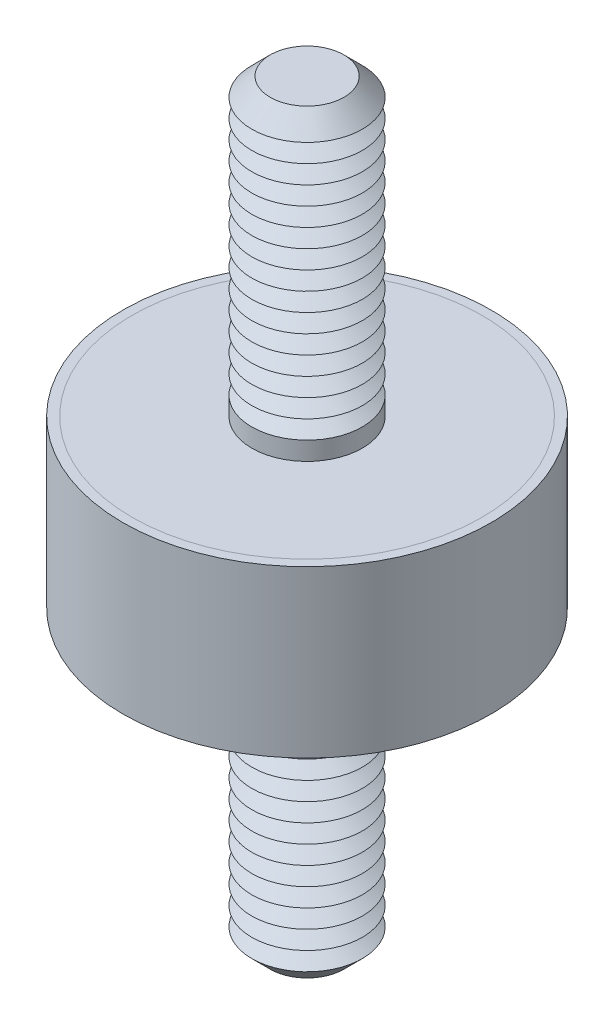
ISO-10303-21;
HEADER;
FILE_DESCRIPTION(('STEP AP214'),'2;1');
FILE_NAME('part.step','',(''),(''),'','','');
FILE_SCHEMA(('AUTOMOTIVE_DESIGN { 1 0 10303 214 1 1 1 1 }'));
ENDSEC;
DATA;
#1=APPLICATION_CONTEXT('core data for automotive mechanical design processes');
#2=APPLICATION_PROTOCOL_DEFINITION('international standard','automotive_design',2000,#1);
#3=PRODUCT_CONTEXT('',#1,'mechanical');
#4=PRODUCT('Part','Part','',(#3));
#5=PRODUCT_RELATED_PRODUCT_CATEGORY('part','',(#4));
#6=PRODUCT_DEFINITION_FORMATION('','',#4);
#7=PRODUCT_DEFINITION_CONTEXT('part definition',#1,'design');
#8=PRODUCT_DEFINITION('design','',#6,#7);
#9=PRODUCT_DEFINITION_SHAPE('','',#8);
#10=(LENGTH_UNIT() NAMED_UNIT(*) SI_UNIT(.MILLI.,.METRE.));
#11=(NAMED_UNIT(*) PLANE_ANGLE_UNIT() SI_UNIT($,.RADIAN.));
#12=(NAMED_UNIT(*) SI_UNIT($,.STERADIAN.) SOLID_ANGLE_UNIT());
#13=UNCERTAINTY_MEASURE_WITH_UNIT(LENGTH_MEASURE(1.E-05),#10,'distance_accuracy_value','');
#14=(GEOMETRIC_REPRESENTATION_CONTEXT(3) GLOBAL_UNCERTAINTY_ASSIGNED_CONTEXT((#13)) GLOBAL_UNIT_ASSIGNED_CONTEXT((#10,
#11,#12)) REPRESENTATION_CONTEXT('',''));
#15=CARTESIAN_POINT('',(0.,0.,0.));
#16=DIRECTION('',(0.,0.,1.));
#17=DIRECTION('',(1.,0.,0.));
#18=AXIS2_PLACEMENT_3D('',#15,#16,#17);
#19=CARTESIAN_POINT('',(0.,-20.5,0.));
#20=DIRECTION('',(0.,1.,0.));
#21=DIRECTION('',(0.,0.,1.));
#22=AXIS2_PLACEMENT_3D('',#19,#20,#21);
#23=CYLINDRICAL_SURFACE('',#22,3.);
#24=CARTESIAN_POINT('',(0.,-4.5,0.));
#25=DIRECTION('',(0.,-1.,0.));
#26=DIRECTION('',(0.,0.,-1.));
#27=AXIS2_PLACEMENT_3D('',#24,#25,#26);
#28=CIRCLE('',#27,3.);
#29=CARTESIAN_POINT('',(0.,-4.5,-3.));
#30=VERTEX_POINT('',#29);
#31=EDGE_CURVE('P0_E21',#30,#30,#28,.T.);
#32=ORIENTED_EDGE('',*,*,#31,.T.);
#33=EDGE_LOOP('',(#32));
#34=FACE_BOUND('',#33,.T.);
#35=CARTESIAN_POINT('',(0.,-5.5,0.));
#36=DIRECTION('',(0.,1.,0.));
#37=DIRECTION('',(0.,0.,1.));
#38=AXIS2_PLACEMENT_3D('',#35,#36,#37);
#39=CIRCLE('',#38,3.);
#40=CARTESIAN_POINT('',(0.,-5.5,3.));
#41=VERTEX_POINT('',#40);
#42=EDGE_CURVE('P0_E33',#41,#41,#39,.T.);
#43=ORIENTED_EDGE('',*,*,#42,.T.);
#44=EDGE_LOOP('',(#43));
#45=FACE_BOUND('',#44,.T.);
#46=ADVANCED_FACE('P0_F14',(#34,#45),#23,.T.);
#47=CARTESIAN_POINT('',(0.,-4.5,0.));
#48=DIRECTION('',(0.,1.,0.));
#49=DIRECTION('',(0.,0.,1.));
#50=AXIS2_PLACEMENT_3D('',#47,#48,#49);
#51=CYLINDRICAL_SURFACE('',#50,9.5);
#52=CARTESIAN_POINT('',(0.,-4.5,0.));
#53=DIRECTION('',(0.,1.,0.));
#54=DIRECTION('',(0.,0.,1.));
#55=AXIS2_PLACEMENT_3D('',#52,#53,#54);
#56=CIRCLE('',#55,9.5);
#57=CARTESIAN_POINT('',(0.,-4.5,9.5));
#58=VERTEX_POINT('',#57);
#59=EDGE_CURVE('P0_E25',#58,#58,#56,.T.);
#60=ORIENTED_EDGE('',*,*,#59,.T.);
#61=EDGE_LOOP('',(#60));
#62=FACE_BOUND('',#61,.T.);
#63=CARTESIAN_POINT('',(0.,-4.,0.));
#64=DIRECTION('',(0.,1.,0.));
#65=DIRECTION('',(0.,0.,1.));
#66=AXIS2_PLACEMENT_3D('',#63,#64,#65);
#67=CIRCLE('',#66,9.5);
#68=CARTESIAN_POINT('',(0.,-4.,9.5));
#69=VERTEX_POINT('',#68);
#70=EDGE_CURVE('P0_E30',#69,#69,#67,.T.);
#71=ORIENTED_EDGE('',*,*,#70,.F.);
#72=EDGE_LOOP('',(#71));
#73=FACE_BOUND('',#72,.T.);
#74=ADVANCED_FACE('P0_F145',(#62,#73),#51,.T.);
#75=CARTESIAN_POINT('',(0.,-4.5,0.));
#76=DIRECTION('',(0.,1.,0.));
#77=DIRECTION('',(0.,0.,1.));
#78=AXIS2_PLACEMENT_3D('',#75,#76,#77);
#79=PLANE('',#78);
#80=ORIENTED_EDGE('',*,*,#31,.F.);
#81=EDGE_LOOP('',(#80));
#82=FACE_BOUND('',#81,.T.);
#83=ORIENTED_EDGE('',*,*,#59,.F.);
#84=EDGE_LOOP('',(#83));
#85=FACE_BOUND('',#84,.T.);
#86=ADVANCED_FACE('P0_F150',(#82,#85),#79,.F.);
#87=CARTESIAN_POINT('',(0.,-4.,0.));
#88=DIRECTION('',(0.,1.,0.));
#89=DIRECTION('',(0.,0.,1.));
#90=AXIS2_PLACEMENT_3D('',#87,#88,#89);
#91=PLANE('',#90);
#92=ORIENTED_EDGE('',*,*,#70,.T.);
#93=EDGE_LOOP('',(#92));
#94=FACE_BOUND('',#93,.T.);
#95=ADVANCED_FACE('P0_F156',(#94),#91,.T.);
#96=CARTESIAN_POINT('',(0.,-5.5,0.));
#97=DIRECTION('',(0.,1.,0.));
#98=DIRECTION('',(0.,0.,1.));
#99=AXIS2_PLACEMENT_3D('',#96,#97,#98);
#100=CONICAL_SURFACE('',#99,3.,1.0471975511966);
#101=CARTESIAN_POINT('',(0.,-6.,0.));
#102=DIRECTION('',(0.,1.,0.));
#103=DIRECTION('',(0.,0.,1.));
#104=AXIS2_PLACEMENT_3D('',#101,#102,#103);
#105=CIRCLE('',#104,2.13397459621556);
#106=CARTESIAN_POINT('',(0.,-6.,2.13397459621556));
#107=VERTEX_POINT('',#106);
#108=EDGE_CURVE('P0_E39',#107,#107,#105,.T.);
#109=ORIENTED_EDGE('',*,*,#108,.T.);
#110=EDGE_LOOP('',(#109));
#111=FACE_BOUND('',#110,.T.);
#112=ORIENTED_EDGE('',*,*,#42,.F.);
#113=EDGE_LOOP('',(#112));
#114=FACE_BOUND('',#113,.T.);
#115=ADVANCED_FACE('P0_F159',(#111,#114),#100,.T.);
#116=CARTESIAN_POINT('',(0.,-6.,0.));
#117=DIRECTION('',(0.,-1.,0.));
#118=DIRECTION('',(0.,0.,-1.));
#119=AXIS2_PLACEMENT_3D('',#116,#117,#118);
#120=CONICAL_SURFACE('',#119,2.13397459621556,1.0471975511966);
#121=CARTESIAN_POINT('',(0.,-6.5,0.));
#122=DIRECTION('',(0.,1.,0.));
#123=DIRECTION('',(0.,0.,1.));
#124=AXIS2_PLACEMENT_3D('',#121,#122,#123);
#125=CIRCLE('',#124,3.);
#126=CARTESIAN_POINT('',(0.,-6.5,3.));
#127=VERTEX_POINT('',#126);
#128=EDGE_CURVE('P0_E43',#127,#127,#125,.T.);
#129=ORIENTED_EDGE('',*,*,#128,.T.);
#130=EDGE_LOOP('',(#129));
#131=FACE_BOUND('',#130,.T.);
#132=ORIENTED_EDGE('',*,*,#108,.F.);
#133=EDGE_LOOP('',(#132));
#134=FACE_BOUND('',#133,.T.);
#135=ADVANCED_FACE('P0_F163',(#131,#134),#120,.T.);
#136=CARTESIAN_POINT('',(0.,-6.5,0.));
#137=DIRECTION('',(0.,1.,0.));
#138=DIRECTION('',(0.,0.,1.));
#139=AXIS2_PLACEMENT_3D('',#136,#137,#138);
#140=CONICAL_SURFACE('',#139,3.,1.0471975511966);
#141=CARTESIAN_POINT('',(0.,-7.,0.));
#142=DIRECTION('',(0.,1.,0.));
#143=DIRECTION('',(0.,0.,1.));
#144=AXIS2_PLACEMENT_3D('',#141,#142,#143);
#145=CIRCLE('',#144,2.13397459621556);
#146=CARTESIAN_POINT('',(0.,-7.,2.13397459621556));
#147=VERTEX_POINT('',#146);
#148=EDGE_CURVE('P0_E47',#147,#147,#145,.T.);
#149=ORIENTED_EDGE('',*,*,#148,.T.);
#150=EDGE_LOOP('',(#149));
#151=FACE_BOUND('',#150,.T.);
#152=ORIENTED_EDGE('',*,*,#128,.F.);
#153=EDGE_LOOP('',(#152));
#154=FACE_BOUND('',#153,.T.);
#155=ADVANCED_FACE('P0_F167',(#151,#154),#140,.T.);
#156=CARTESIAN_POINT('',(0.,-7.,0.));
#157=DIRECTION('',(0.,-1.,0.));
#158=DIRECTION('',(0.,0.,-1.));
#159=AXIS2_PLACEMENT_3D('',#156,#157,#158);
#160=CONICAL_SURFACE('',#159,2.13397459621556,1.0471975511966);
#161=CARTESIAN_POINT('',(0.,-7.5,0.));
#162=DIRECTION('',(0.,1.,0.));
#163=DIRECTION('',(0.,0.,1.));
#164=AXIS2_PLACEMENT_3D('',#161,#162,#163);
#165=CIRCLE('',#164,3.);
#166=CARTESIAN_POINT('',(0.,-7.5,3.));
#167=VERTEX_POINT('',#166);
#168=EDGE_CURVE('P0_E52',#167,#167,#165,.T.);
#169=ORIENTED_EDGE('',*,*,#168,.T.);
#170=EDGE_LOOP('',(#169));
#171=FACE_BOUND('',#170,.T.);
#172=ORIENTED_EDGE('',*,*,#148,.F.);
#173=EDGE_LOOP('',(#172));
#174=FACE_BOUND('',#173,.T.);
#175=ADVANCED_FACE('P0_F174',(#171,#174),#160,.T.);
#176=CARTESIAN_POINT('',(0.,-7.5,0.));
#177=DIRECTION('',(0.,1.,0.));
#178=DIRECTION('',(0.,0.,1.));
#179=AXIS2_PLACEMENT_3D('',#176,#177,#178);
#180=CONICAL_SURFACE('',#179,3.,1.0471975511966);
#181=CARTESIAN_POINT('',(0.,-8.,0.));
#182=DIRECTION('',(0.,1.,0.));
#183=DIRECTION('',(0.,0.,1.));
#184=AXIS2_PLACEMENT_3D('',#181,#182,#183);
#185=CIRCLE('',#184,2.13397459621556);
#186=CARTESIAN_POINT('',(0.,-8.,2.13397459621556));
#187=VERTEX_POINT('',#186);
#188=EDGE_CURVE('P0_E55',#187,#187,#185,.T.);
#189=ORIENTED_EDGE('',*,*,#188,.T.);
#190=EDGE_LOOP('',(#189));
#191=FACE_BOUND('',#190,.T.);
#192=ORIENTED_EDGE('',*,*,#168,.F.);
#193=EDGE_LOOP('',(#192));
#194=FACE_BOUND('',#193,.T.);
#195=ADVANCED_FACE('P0_F178',(#191,#194),#180,.T.);
#196=CARTESIAN_POINT('',(0.,-8.,0.));
#197=DIRECTION('',(0.,-1.,0.));
#198=DIRECTION('',(0.,0.,-1.));
#199=AXIS2_PLACEMENT_3D('',#196,#197,#198);
#200=CONICAL_SURFACE('',#199,2.13397459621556,1.0471975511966);
#201=CARTESIAN_POINT('',(0.,-8.5,0.));
#202=DIRECTION('',(0.,1.,0.));
#203=DIRECTION('',(0.,0.,1.));
#204=AXIS2_PLACEMENT_3D('',#201,#202,#203);
#205=CIRCLE('',#204,3.);
#206=CARTESIAN_POINT('',(0.,-8.5,3.));
#207=VERTEX_POINT('',#206);
#208=EDGE_CURVE('P0_E58',#207,#207,#205,.T.);
#209=ORIENTED_EDGE('',*,*,#208,.T.);
#210=EDGE_LOOP('',(#209));
#211=FACE_BOUND('',#210,.T.);
#212=ORIENTED_EDGE('',*,*,#188,.F.);
#213=EDGE_LOOP('',(#212));
#214=FACE_BOUND('',#213,.T.);
#215=ADVANCED_FACE('P0_F182',(#211,#214),#200,.T.);
#216=CARTESIAN_POINT('',(0.,-8.5,0.));
#217=DIRECTION('',(0.,1.,0.));
#218=DIRECTION('',(0.,0.,1.));
#219=AXIS2_PLACEMENT_3D('',#216,#217,#218);
#220=CONICAL_SURFACE('',#219,3.,1.0471975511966);
#221=CARTESIAN_POINT('',(0.,-9.,0.));
#222=DIRECTION('',(0.,1.,0.));
#223=DIRECTION('',(0.,0.,1.));
#224=AXIS2_PLACEMENT_3D('',#221,#222,#223);
#225=CIRCLE('',#224,2.13397459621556);
#226=CARTESIAN_POINT('',(0.,-9.,2.13397459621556));
#227=VERTEX_POINT('',#226);
#228=EDGE_CURVE('P0_E61',#227,#227,#225,.T.);
#229=ORIENTED_EDGE('',*,*,#228,.T.);
#230=EDGE_LOOP('',(#229));
#231=FACE_BOUND('',#230,.T.);
#232=ORIENTED_EDGE('',*,*,#208,.F.);
#233=EDGE_LOOP('',(#232));
#234=FACE_BOUND('',#233,.T.);
#235=ADVANCED_FACE('P0_F186',(#231,#234),#220,.T.);
#236=CARTESIAN_POINT('',(0.,-9.,0.));
#237=DIRECTION('',(0.,-1.,0.));
#238=DIRECTION('',(0.,0.,-1.));
#239=AXIS2_PLACEMENT_3D('',#236,#237,#238);
#240=CONICAL_SURFACE('',#239,2.13397459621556,1.0471975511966);
#241=CARTESIAN_POINT('',(0.,-9.5,0.));
#242=DIRECTION('',(0.,1.,0.));
#243=DIRECTION('',(0.,0.,1.));
#244=AXIS2_PLACEMENT_3D('',#241,#242,#243);
#245=CIRCLE('',#244,3.);
#246=CARTESIAN_POINT('',(0.,-9.5,3.));
#247=VERTEX_POINT('',#246);
#248=EDGE_CURVE('P0_E64',#247,#247,#245,.T.);
#249=ORIENTED_EDGE('',*,*,#248,.T.);
#250=EDGE_LOOP('',(#249));
#251=FACE_BOUND('',#250,.T.);
#252=ORIENTED_EDGE('',*,*,#228,.F.);
#253=EDGE_LOOP('',(#252));
#254=FACE_BOUND('',#253,.T.);
#255=ADVANCED_FACE('P0_F190',(#251,#254),#240,.T.);
#256=CARTESIAN_POINT('',(0.,-9.5,0.));
#257=DIRECTION('',(0.,1.,0.));
#258=DIRECTION('',(0.,0.,1.));
#259=AXIS2_PLACEMENT_3D('',#256,#257,#258);
#260=CONICAL_SURFACE('',#259,3.,1.0471975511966);
#261=CARTESIAN_POINT('',(0.,-10.,0.));
#262=DIRECTION('',(0.,1.,0.));
#263=DIRECTION('',(0.,0.,1.));
#264=AXIS2_PLACEMENT_3D('',#261,#262,#263);
#265=CIRCLE('',#264,2.13397459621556);
#266=CARTESIAN_POINT('',(0.,-10.,2.13397459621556));
#267=VERTEX_POINT('',#266);
#268=EDGE_CURVE('P0_E67',#267,#267,#265,.T.);
#269=ORIENTED_EDGE('',*,*,#268,.T.);
#270=EDGE_LOOP('',(#269));
#271=FACE_BOUND('',#270,.T.);
#272=ORIENTED_EDGE('',*,*,#248,.F.);
#273=EDGE_LOOP('',(#272));
#274=FACE_BOUND('',#273,.T.);
#275=ADVANCED_FACE('P0_F194',(#271,#274),#260,.T.);
#276=CARTESIAN_POINT('',(0.,-10.,0.));
#277=DIRECTION('',(0.,-1.,0.));
#278=DIRECTION('',(0.,0.,-1.));
#279=AXIS2_PLACEMENT_3D('',#276,#277,#278);
#280=CONICAL_SURFACE('',#279,2.13397459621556,1.0471975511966);
#281=CARTESIAN_POINT('',(0.,-10.5,0.));
#282=DIRECTION('',(0.,1.,0.));
#283=DIRECTION('',(0.,0.,1.));
#284=AXIS2_PLACEMENT_3D('',#281,#282,#283);
#285=CIRCLE('',#284,3.);
#286=CARTESIAN_POINT('',(0.,-10.5,3.));
#287=VERTEX_POINT('',#286);
#288=EDGE_CURVE('P0_E70',#287,#287,#285,.T.);
#289=ORIENTED_EDGE('',*,*,#288,.T.);
#290=EDGE_LOOP('',(#289));
#291=FACE_BOUND('',#290,.T.);
#292=ORIENTED_EDGE('',*,*,#268,.F.);
#293=EDGE_LOOP('',(#292));
#294=FACE_BOUND('',#293,.T.);
#295=ADVANCED_FACE('P0_F198',(#291,#294),#280,.T.);
#296=CARTESIAN_POINT('',(0.,-10.5,0.));
#297=DIRECTION('',(0.,1.,0.));
#298=DIRECTION('',(0.,0.,1.));
#299=AXIS2_PLACEMENT_3D('',#296,#297,#298);
#300=CONICAL_SURFACE('',#299,3.,1.0471975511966);
#301=CARTESIAN_POINT('',(0.,-11.,0.));
#302=DIRECTION('',(0.,1.,0.));
#303=DIRECTION('',(0.,0.,1.));
#304=AXIS2_PLACEMENT_3D('',#301,#302,#303);
#305=CIRCLE('',#304,2.13397459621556);
#306=CARTESIAN_POINT('',(0.,-11.,2.13397459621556));
#307=VERTEX_POINT('',#306);
#308=EDGE_CURVE('P0_E73',#307,#307,#305,.T.);
#309=ORIENTED_EDGE('',*,*,#308,.T.);
#310=EDGE_LOOP('',(#309));
#311=FACE_BOUND('',#310,.T.);
#312=ORIENTED_EDGE('',*,*,#288,.F.);
#313=EDGE_LOOP('',(#312));
#314=FACE_BOUND('',#313,.T.);
#315=ADVANCED_FACE('P0_F202',(#311,#314),#300,.T.);
#316=CARTESIAN_POINT('',(0.,-11.,0.));
#317=DIRECTION('',(0.,-1.,0.));
#318=DIRECTION('',(0.,0.,-1.));
#319=AXIS2_PLACEMENT_3D('',#316,#317,#318);
#320=CONICAL_SURFACE('',#319,2.13397459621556,1.0471975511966);
#321=CARTESIAN_POINT('',(0.,-11.5,0.));
#322=DIRECTION('',(0.,1.,0.));
#323=DIRECTION('',(0.,0.,1.));
#324=AXIS2_PLACEMENT_3D('',#321,#322,#323);
#325=CIRCLE('',#324,3.);
#326=CARTESIAN_POINT('',(0.,-11.5,3.));
#327=VERTEX_POINT('',#326);
#328=EDGE_CURVE('P0_E76',#327,#327,#325,.T.);
#329=ORIENTED_EDGE('',*,*,#328,.T.);
#330=EDGE_LOOP('',(#329));
#331=FACE_BOUND('',#330,.T.);
#332=ORIENTED_EDGE('',*,*,#308,.F.);
#333=EDGE_LOOP('',(#332));
#334=FACE_BOUND('',#333,.T.);
#335=ADVANCED_FACE('P0_F206',(#331,#334),#320,.T.);
#336=CARTESIAN_POINT('',(0.,-11.5,0.));
#337=DIRECTION('',(0.,1.,0.));
#338=DIRECTION('',(0.,0.,1.));
#339=AXIS2_PLACEMENT_3D('',#336,#337,#338);
#340=CONICAL_SURFACE('',#339,3.,1.0471975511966);
#341=CARTESIAN_POINT('',(0.,-12.,0.));
#342=DIRECTION('',(0.,1.,0.));
#343=DIRECTION('',(0.,0.,1.));
#344=AXIS2_PLACEMENT_3D('',#341,#342,#343);
#345=CIRCLE('',#344,2.13397459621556);
#346=CARTESIAN_POINT('',(0.,-12.,2.13397459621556));
#347=VERTEX_POINT('',#346);
#348=EDGE_CURVE('P0_E79',#347,#347,#345,.T.);
#349=ORIENTED_EDGE('',*,*,#348,.T.);
#350=EDGE_LOOP('',(#349));
#351=FACE_BOUND('',#350,.T.);
#352=ORIENTED_EDGE('',*,*,#328,.F.);
#353=EDGE_LOOP('',(#352));
#354=FACE_BOUND('',#353,.T.);
#355=ADVANCED_FACE('P0_F210',(#351,#354),#340,.T.);
#356=CARTESIAN_POINT('',(0.,-12.,0.));
#357=DIRECTION('',(0.,-1.,0.));
#358=DIRECTION('',(0.,0.,-1.));
#359=AXIS2_PLACEMENT_3D('',#356,#357,#358);
#360=CONICAL_SURFACE('',#359,2.13397459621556,1.0471975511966);
#361=CARTESIAN_POINT('',(0.,-12.5,0.));
#362=DIRECTION('',(0.,1.,0.));
#363=DIRECTION('',(0.,0.,1.));
#364=AXIS2_PLACEMENT_3D('',#361,#362,#363);
#365=CIRCLE('',#364,3.);
#366=CARTESIAN_POINT('',(0.,-12.5,3.));
#367=VERTEX_POINT('',#366);
#368=EDGE_CURVE('P0_E82',#367,#367,#365,.T.);
#369=ORIENTED_EDGE('',*,*,#368,.T.);
#370=EDGE_LOOP('',(#369));
#371=FACE_BOUND('',#370,.T.);
#372=ORIENTED_EDGE('',*,*,#348,.F.);
#373=EDGE_LOOP('',(#372));
#374=FACE_BOUND('',#373,.T.);
#375=ADVANCED_FACE('P0_F214',(#371,#374),#360,.T.);
#376=CARTESIAN_POINT('',(0.,-12.5,0.));
#377=DIRECTION('',(0.,1.,0.));
#378=DIRECTION('',(0.,0.,1.));
#379=AXIS2_PLACEMENT_3D('',#376,#377,#378);
#380=CONICAL_SURFACE('',#379,3.,1.0471975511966);
#381=CARTESIAN_POINT('',(0.,-13.,0.));
#382=DIRECTION('',(0.,1.,0.));
#383=DIRECTION('',(0.,0.,1.));
#384=AXIS2_PLACEMENT_3D('',#381,#382,#383);
#385=CIRCLE('',#384,2.13397459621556);
#386=CARTESIAN_POINT('',(0.,-13.,2.13397459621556));
#387=VERTEX_POINT('',#386);
#388=EDGE_CURVE('P0_E85',#387,#387,#385,.T.);
#389=ORIENTED_EDGE('',*,*,#388,.T.);
#390=EDGE_LOOP('',(#389));
#391=FACE_BOUND('',#390,.T.);
#392=ORIENTED_EDGE('',*,*,#368,.F.);
#393=EDGE_LOOP('',(#392));
#394=FACE_BOUND('',#393,.T.);
#395=ADVANCED_FACE('P0_F218',(#391,#394),#380,.T.);
#396=CARTESIAN_POINT('',(0.,-13.,0.));
#397=DIRECTION('',(0.,-1.,0.));
#398=DIRECTION('',(0.,0.,-1.));
#399=AXIS2_PLACEMENT_3D('',#396,#397,#398);
#400=CONICAL_SURFACE('',#399,2.13397459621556,1.0471975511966);
#401=CARTESIAN_POINT('',(0.,-13.5,0.));
#402=DIRECTION('',(0.,1.,0.));
#403=DIRECTION('',(0.,0.,1.));
#404=AXIS2_PLACEMENT_3D('',#401,#402,#403);
#405=CIRCLE('',#404,3.);
#406=CARTESIAN_POINT('',(0.,-13.5,3.));
#407=VERTEX_POINT('',#406);
#408=EDGE_CURVE('P0_E88',#407,#407,#405,.T.);
#409=ORIENTED_EDGE('',*,*,#408,.T.);
#410=EDGE_LOOP('',(#409));
#411=FACE_BOUND('',#410,.T.);
#412=ORIENTED_EDGE('',*,*,#388,.F.);
#413=EDGE_LOOP('',(#412));
#414=FACE_BOUND('',#413,.T.);
#415=ADVANCED_FACE('P0_F222',(#411,#414),#400,.T.);
#416=CARTESIAN_POINT('',(0.,-13.5,0.));
#417=DIRECTION('',(0.,1.,0.));
#418=DIRECTION('',(0.,0.,1.));
#419=AXIS2_PLACEMENT_3D('',#416,#417,#418);
#420=CONICAL_SURFACE('',#419,3.,1.0471975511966);
#421=CARTESIAN_POINT('',(0.,-14.,0.));
#422=DIRECTION('',(0.,1.,0.));
#423=DIRECTION('',(0.,0.,1.));
#424=AXIS2_PLACEMENT_3D('',#421,#422,#423);
#425=CIRCLE('',#424,2.13397459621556);
#426=CARTESIAN_POINT('',(0.,-14.,2.13397459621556));
#427=VERTEX_POINT('',#426);
#428=EDGE_CURVE('P0_E91',#427,#427,#425,.T.);
#429=ORIENTED_EDGE('',*,*,#428,.T.);
#430=EDGE_LOOP('',(#429));
#431=FACE_BOUND('',#430,.T.);
#432=ORIENTED_EDGE('',*,*,#408,.F.);
#433=EDGE_LOOP('',(#432));
#434=FACE_BOUND('',#433,.T.);
#435=ADVANCED_FACE('P0_F226',(#431,#434),#420,.T.);
#436=CARTESIAN_POINT('',(0.,-14.,0.));
#437=DIRECTION('',(0.,-1.,0.));
#438=DIRECTION('',(0.,0.,-1.));
#439=AXIS2_PLACEMENT_3D('',#436,#437,#438);
#440=CONICAL_SURFACE('',#439,2.13397459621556,1.0471975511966);
#441=CARTESIAN_POINT('',(0.,-14.5,0.));
#442=DIRECTION('',(0.,1.,0.));
#443=DIRECTION('',(0.,0.,1.));
#444=AXIS2_PLACEMENT_3D('',#441,#442,#443);
#445=CIRCLE('',#444,3.);
#446=CARTESIAN_POINT('',(0.,-14.5,3.));
#447=VERTEX_POINT('',#446);
#448=EDGE_CURVE('P0_E94',#447,#447,#445,.T.);
#449=ORIENTED_EDGE('',*,*,#448,.T.);
#450=EDGE_LOOP('',(#449));
#451=FACE_BOUND('',#450,.T.);
#452=ORIENTED_EDGE('',*,*,#428,.F.);
#453=EDGE_LOOP('',(#452));
#454=FACE_BOUND('',#453,.T.);
#455=ADVANCED_FACE('P0_F230',(#451,#454),#440,.T.);
#456=CARTESIAN_POINT('',(0.,-14.5,0.));
#457=DIRECTION('',(0.,1.,0.));
#458=DIRECTION('',(0.,0.,1.));
#459=AXIS2_PLACEMENT_3D('',#456,#457,#458);
#460=CONICAL_SURFACE('',#459,3.,1.0471975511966);
#461=CARTESIAN_POINT('',(0.,-15.,0.));
#462=DIRECTION('',(0.,1.,0.));
#463=DIRECTION('',(0.,0.,1.));
#464=AXIS2_PLACEMENT_3D('',#461,#462,#463);
#465=CIRCLE('',#464,2.13397459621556);
#466=CARTESIAN_POINT('',(0.,-15.,2.13397459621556));
#467=VERTEX_POINT('',#466);
#468=EDGE_CURVE('P0_E97',#467,#467,#465,.T.);
#469=ORIENTED_EDGE('',*,*,#468,.T.);
#470=EDGE_LOOP('',(#469));
#471=FACE_BOUND('',#470,.T.);
#472=ORIENTED_EDGE('',*,*,#448,.F.);
#473=EDGE_LOOP('',(#472));
#474=FACE_BOUND('',#473,.T.);
#475=ADVANCED_FACE('P0_F234',(#471,#474),#460,.T.);
#476=CARTESIAN_POINT('',(0.,-15.,0.));
#477=DIRECTION('',(0.,-1.,0.));
#478=DIRECTION('',(0.,0.,-1.));
#479=AXIS2_PLACEMENT_3D('',#476,#477,#478);
#480=CONICAL_SURFACE('',#479,2.13397459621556,1.0471975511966);
#481=CARTESIAN_POINT('',(0.,-15.5,0.));
#482=DIRECTION('',(0.,1.,0.));
#483=DIRECTION('',(0.,0.,1.));
#484=AXIS2_PLACEMENT_3D('',#481,#482,#483);
#485=CIRCLE('',#484,3.);
#486=CARTESIAN_POINT('',(0.,-15.5,3.));
#487=VERTEX_POINT('',#486);
#488=EDGE_CURVE('P0_E100',#487,#487,#485,.T.);
#489=ORIENTED_EDGE('',*,*,#488,.T.);
#490=EDGE_LOOP('',(#489));
#491=FACE_BOUND('',#490,.T.);
#492=ORIENTED_EDGE('',*,*,#468,.F.);
#493=EDGE_LOOP('',(#492));
#494=FACE_BOUND('',#493,.T.);
#495=ADVANCED_FACE('P0_F238',(#491,#494),#480,.T.);
#496=CARTESIAN_POINT('',(0.,-15.5,0.));
#497=DIRECTION('',(0.,1.,0.));
#498=DIRECTION('',(0.,0.,1.));
#499=AXIS2_PLACEMENT_3D('',#496,#497,#498);
#500=CONICAL_SURFACE('',#499,3.,1.0471975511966);
#501=CARTESIAN_POINT('',(0.,-16.,0.));
#502=DIRECTION('',(0.,1.,0.));
#503=DIRECTION('',(0.,0.,1.));
#504=AXIS2_PLACEMENT_3D('',#501,#502,#503);
#505=CIRCLE('',#504,2.13397459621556);
#506=CARTESIAN_POINT('',(0.,-16.,2.13397459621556));
#507=VERTEX_POINT('',#506);
#508=EDGE_CURVE('P0_E103',#507,#507,#505,.T.);
#509=ORIENTED_EDGE('',*,*,#508,.T.);
#510=EDGE_LOOP('',(#509));
#511=FACE_BOUND('',#510,.T.);
#512=ORIENTED_EDGE('',*,*,#488,.F.);
#513=EDGE_LOOP('',(#512));
#514=FACE_BOUND('',#513,.T.);
#515=ADVANCED_FACE('P0_F242',(#511,#514),#500,.T.);
#516=CARTESIAN_POINT('',(0.,-16.,0.));
#517=DIRECTION('',(0.,-1.,0.));
#518=DIRECTION('',(0.,0.,-1.));
#519=AXIS2_PLACEMENT_3D('',#516,#517,#518);
#520=CONICAL_SURFACE('',#519,2.13397459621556,1.0471975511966);
#521=CARTESIAN_POINT('',(0.,-16.5,0.));
#522=DIRECTION('',(0.,1.,0.));
#523=DIRECTION('',(0.,0.,1.));
#524=AXIS2_PLACEMENT_3D('',#521,#522,#523);
#525=CIRCLE('',#524,3.);
#526=CARTESIAN_POINT('',(0.,-16.5,3.));
#527=VERTEX_POINT('',#526);
#528=EDGE_CURVE('P0_E106',#527,#527,#525,.T.);
#529=ORIENTED_EDGE('',*,*,#528,.T.);
#530=EDGE_LOOP('',(#529));
#531=FACE_BOUND('',#530,.T.);
#532=ORIENTED_EDGE('',*,*,#508,.F.);
#533=EDGE_LOOP('',(#532));
#534=FACE_BOUND('',#533,.T.);
#535=ADVANCED_FACE('P0_F246',(#531,#534),#520,.T.);
#536=CARTESIAN_POINT('',(0.,-16.5,0.));
#537=DIRECTION('',(0.,1.,0.));
#538=DIRECTION('',(0.,0.,1.));
#539=AXIS2_PLACEMENT_3D('',#536,#537,#538);
#540=CONICAL_SURFACE('',#539,3.,1.0471975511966);
#541=CARTESIAN_POINT('',(0.,-17.,0.));
#542=DIRECTION('',(0.,1.,0.));
#543=DIRECTION('',(0.,0.,1.));
#544=AXIS2_PLACEMENT_3D('',#541,#542,#543);
#545=CIRCLE('',#544,2.13397459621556);
#546=CARTESIAN_POINT('',(0.,-17.,2.13397459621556));
#547=VERTEX_POINT('',#546);
#548=EDGE_CURVE('P0_E109',#547,#547,#545,.T.);
#549=ORIENTED_EDGE('',*,*,#548,.T.);
#550=EDGE_LOOP('',(#549));
#551=FACE_BOUND('',#550,.T.);
#552=ORIENTED_EDGE('',*,*,#528,.F.);
#553=EDGE_LOOP('',(#552));
#554=FACE_BOUND('',#553,.T.);
#555=ADVANCED_FACE('P0_F250',(#551,#554),#540,.T.);
#556=CARTESIAN_POINT('',(0.,-17.,0.));
#557=DIRECTION('',(0.,-1.,0.));
#558=DIRECTION('',(0.,0.,-1.));
#559=AXIS2_PLACEMENT_3D('',#556,#557,#558);
#560=CONICAL_SURFACE('',#559,2.13397459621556,1.0471975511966);
#561=CARTESIAN_POINT('',(0.,-17.5,0.));
#562=DIRECTION('',(0.,1.,0.));
#563=DIRECTION('',(0.,0.,1.));
#564=AXIS2_PLACEMENT_3D('',#561,#562,#563);
#565=CIRCLE('',#564,3.);
#566=CARTESIAN_POINT('',(0.,-17.5,3.));
#567=VERTEX_POINT('',#566);
#568=EDGE_CURVE('P0_E112',#567,#567,#565,.T.);
#569=ORIENTED_EDGE('',*,*,#568,.T.);
#570=EDGE_LOOP('',(#569));
#571=FACE_BOUND('',#570,.T.);
#572=ORIENTED_EDGE('',*,*,#548,.F.);
#573=EDGE_LOOP('',(#572));
#574=FACE_BOUND('',#573,.T.);
#575=ADVANCED_FACE('P0_F254',(#571,#574),#560,.T.);
#576=CARTESIAN_POINT('',(0.,-17.5,0.));
#577=DIRECTION('',(0.,1.,0.));
#578=DIRECTION('',(0.,0.,1.));
#579=AXIS2_PLACEMENT_3D('',#576,#577,#578);
#580=CONICAL_SURFACE('',#579,3.,1.0471975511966);
#581=CARTESIAN_POINT('',(0.,-18.,0.));
#582=DIRECTION('',(0.,1.,0.));
#583=DIRECTION('',(0.,0.,1.));
#584=AXIS2_PLACEMENT_3D('',#581,#582,#583);
#585=CIRCLE('',#584,2.13397459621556);
#586=CARTESIAN_POINT('',(0.,-18.,2.13397459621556));
#587=VERTEX_POINT('',#586);
#588=EDGE_CURVE('P0_E115',#587,#587,#585,.T.);
#589=ORIENTED_EDGE('',*,*,#588,.T.);
#590=EDGE_LOOP('',(#589));
#591=FACE_BOUND('',#590,.T.);
#592=ORIENTED_EDGE('',*,*,#568,.F.);
#593=EDGE_LOOP('',(#592));
#594=FACE_BOUND('',#593,.T.);
#595=ADVANCED_FACE('P0_F258',(#591,#594),#580,.T.);
#596=CARTESIAN_POINT('',(0.,-18.,0.));
#597=DIRECTION('',(0.,-1.,0.));
#598=DIRECTION('',(0.,0.,-1.));
#599=AXIS2_PLACEMENT_3D('',#596,#597,#598);
#600=CONICAL_SURFACE('',#599,2.13397459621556,1.0471975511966);
#601=CARTESIAN_POINT('',(0.,-18.5,0.));
#602=DIRECTION('',(0.,1.,0.));
#603=DIRECTION('',(0.,0.,1.));
#604=AXIS2_PLACEMENT_3D('',#601,#602,#603);
#605=CIRCLE('',#604,3.);
#606=CARTESIAN_POINT('',(0.,-18.5,3.));
#607=VERTEX_POINT('',#606);
#608=EDGE_CURVE('P0_E118',#607,#607,#605,.T.);
#609=ORIENTED_EDGE('',*,*,#608,.T.);
#610=EDGE_LOOP('',(#609));
#611=FACE_BOUND('',#610,.T.);
#612=ORIENTED_EDGE('',*,*,#588,.F.);
#613=EDGE_LOOP('',(#612));
#614=FACE_BOUND('',#613,.T.);
#615=ADVANCED_FACE('P0_F142',(#611,#614),#600,.T.);
#616=CARTESIAN_POINT('',(0.,-18.5,0.));
#617=DIRECTION('',(0.,1.,0.));
#618=DIRECTION('',(0.,0.,1.));
#619=AXIS2_PLACEMENT_3D('',#616,#617,#618);
#620=CONICAL_SURFACE('',#619,3.,1.0471975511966);
#621=CARTESIAN_POINT('',(0.,-19.,0.));
#622=DIRECTION('',(0.,1.,0.));
#623=DIRECTION('',(0.,0.,1.));
#624=AXIS2_PLACEMENT_3D('',#621,#622,#623);
#625=CIRCLE('',#624,2.13397459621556);
#626=CARTESIAN_POINT('',(0.,-19.,2.13397459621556));
#627=VERTEX_POINT('',#626);
#628=EDGE_CURVE('P0_E124',#627,#627,#625,.T.);
#629=ORIENTED_EDGE('',*,*,#628,.T.);
#630=EDGE_LOOP('',(#629));
#631=FACE_BOUND('',#630,.T.);
#632=ORIENTED_EDGE('',*,*,#608,.F.);
#633=EDGE_LOOP('',(#632));
#634=FACE_BOUND('',#633,.T.);
#635=ADVANCED_FACE('P0_F128',(#631,#634),#620,.T.);
#636=CARTESIAN_POINT('',(0.,-19.,0.));
#637=DIRECTION('',(0.,-1.,0.));
#638=DIRECTION('',(0.,0.,-1.));
#639=AXIS2_PLACEMENT_3D('',#636,#637,#638);
#640=CONICAL_SURFACE('',#639,2.13397459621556,1.0471975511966);
#641=CARTESIAN_POINT('',(0.,-19.5,0.));
#642=DIRECTION('',(0.,1.,0.));
#643=DIRECTION('',(0.,0.,1.));
#644=AXIS2_PLACEMENT_3D('',#641,#642,#643);
#645=CIRCLE('',#644,3.);
#646=CARTESIAN_POINT('',(0.,-19.5,3.));
#647=VERTEX_POINT('',#646);
#648=EDGE_CURVE('P0_E121',#647,#647,#645,.T.);
#649=ORIENTED_EDGE('',*,*,#648,.T.);
#650=EDGE_LOOP('',(#649));
#651=FACE_BOUND('',#650,.T.);
#652=ORIENTED_EDGE('',*,*,#628,.F.);
#653=EDGE_LOOP('',(#652));
#654=FACE_BOUND('',#653,.T.);
#655=ADVANCED_FACE('P0_F131',(#651,#654),#640,.T.);
#656=CARTESIAN_POINT('',(0.,-20.5,0.));
#657=DIRECTION('',(0.,-1.,0.));
#658=DIRECTION('',(0.,0.,-1.));
#659=AXIS2_PLACEMENT_3D('',#656,#657,#658);
#660=PLANE('',#659);
#661=CARTESIAN_POINT('',(0.,-20.5,0.));
#662=DIRECTION('',(0.,-1.,0.));
#663=DIRECTION('',(0.,0.,-1.));
#664=AXIS2_PLACEMENT_3D('',#661,#662,#663);
#665=CIRCLE('',#664,2.);
#666=CARTESIAN_POINT('',(0.,-20.5,-2.));
#667=VERTEX_POINT('',#666);
#668=EDGE_CURVE('P0_E10',#667,#667,#665,.T.);
#669=ORIENTED_EDGE('',*,*,#668,.T.);
#670=EDGE_LOOP('',(#669));
#671=FACE_BOUND('',#670,.T.);
#672=ADVANCED_FACE('P0_F133',(#671),#660,.T.);
#673=CARTESIAN_POINT('',(0.,-20.5,0.));
#674=DIRECTION('',(0.,1.,0.));
#675=DIRECTION('',(0.,0.,1.));
#676=AXIS2_PLACEMENT_3D('',#673,#674,#675);
#677=CONICAL_SURFACE('',#676,2.,0.785398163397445);
#678=ORIENTED_EDGE('',*,*,#648,.F.);
#679=EDGE_LOOP('',(#678));
#680=FACE_BOUND('',#679,.T.);
#681=ORIENTED_EDGE('',*,*,#668,.F.);
#682=EDGE_LOOP('',(#681));
#683=FACE_BOUND('',#682,.T.);
#684=ADVANCED_FACE('P0_F16',(#680,#683),#677,.T.);
#685=CLOSED_SHELL('',(#46,#74,#86,#95,#115,#135,#155,#175,#195,#215,#235,#255,#275,#295,#315,
#335,#355,#375,#395,#415,#435,#455,#475,#495,#515,#535,#555,#575,#595,#615,#635,#655,#672,#684));
#686=MANIFOLD_SOLID_BREP('P0_B1',#685);
#687=CARTESIAN_POINT('',(0.,20.5,0.));
#688=DIRECTION('',(0.,-1.,0.));
#689=DIRECTION('',(0.,0.,-1.));
#690=AXIS2_PLACEMENT_3D('',#687,#688,#689);
#691=CYLINDRICAL_SURFACE('',#690,3.);
#692=CARTESIAN_POINT('',(0.,5.5,0.));
#693=DIRECTION('',(0.,1.,0.));
#694=DIRECTION('',(0.,0.,1.));
#695=AXIS2_PLACEMENT_3D('',#692,#693,#694);
#696=CIRCLE('',#695,3.);
#697=CARTESIAN_POINT('',(0.,5.5,3.));
#698=VERTEX_POINT('',#697);
#699=EDGE_CURVE('P1_E33',#698,#698,#696,.T.);
#700=ORIENTED_EDGE('',*,*,#699,.F.);
#701=EDGE_LOOP('',(#700));
#702=FACE_BOUND('',#701,.T.);
#703=CARTESIAN_POINT('',(0.,4.5,0.));
#704=DIRECTION('',(0.,1.,0.));
#705=DIRECTION('',(0.,0.,1.));
#706=AXIS2_PLACEMENT_3D('',#703,#704,#705);
#707=CIRCLE('',#706,3.);
#708=CARTESIAN_POINT('',(0.,4.5,3.));
#709=VERTEX_POINT('',#708);
#710=EDGE_CURVE('P1_E21',#709,#709,#707,.T.);
#711=ORIENTED_EDGE('',*,*,#710,.T.);
#712=EDGE_LOOP('',(#711));
#713=FACE_BOUND('',#712,.T.);
#714=ADVANCED_FACE('P1_F14',(#702,#713),#691,.T.);
#715=CARTESIAN_POINT('',(0.,4.5,0.));
#716=DIRECTION('',(0.,-1.,0.));
#717=DIRECTION('',(0.,0.,-1.));
#718=AXIS2_PLACEMENT_3D('',#715,#716,#717);
#719=CYLINDRICAL_SURFACE('',#718,9.5);
#720=CARTESIAN_POINT('',(0.,4.5,0.));
#721=DIRECTION('',(0.,1.,0.));
#722=DIRECTION('',(0.,0.,1.));
#723=AXIS2_PLACEMENT_3D('',#720,#721,#722);
#724=CIRCLE('',#723,9.5);
#725=CARTESIAN_POINT('',(0.,4.5,9.5));
#726=VERTEX_POINT('',#725);
#727=EDGE_CURVE('P1_E25',#726,#726,#724,.T.);
#728=ORIENTED_EDGE('',*,*,#727,.F.);
#729=EDGE_LOOP('',(#728));
#730=FACE_BOUND('',#729,.T.);
#731=CARTESIAN_POINT('',(0.,4.,0.));
#732=DIRECTION('',(0.,1.,0.));
#733=DIRECTION('',(0.,0.,1.));
#734=AXIS2_PLACEMENT_3D('',#731,#732,#733);
#735=CIRCLE('',#734,9.5);
#736=CARTESIAN_POINT('',(0.,4.,9.5));
#737=VERTEX_POINT('',#736);
#738=EDGE_CURVE('P1_E30',#737,#737,#735,.T.);
#739=ORIENTED_EDGE('',*,*,#738,.T.);
#740=EDGE_LOOP('',(#739));
#741=FACE_BOUND('',#740,.T.);
#742=ADVANCED_FACE('P1_F292',(#730,#741),#719,.T.);
#743=CARTESIAN_POINT('',(0.,4.5,0.));
#744=DIRECTION('',(0.,1.,0.));
#745=DIRECTION('',(0.,0.,1.));
#746=AXIS2_PLACEMENT_3D('',#743,#744,#745);
#747=PLANE('',#746);
#748=ORIENTED_EDGE('',*,*,#710,.F.);
#749=EDGE_LOOP('',(#748));
#750=FACE_BOUND('',#749,.T.);
#751=ORIENTED_EDGE('',*,*,#727,.T.);
#752=EDGE_LOOP('',(#751));
#753=FACE_BOUND('',#752,.T.);
#754=ADVANCED_FACE('P1_F298',(#750,#753),#747,.T.);
#755=CARTESIAN_POINT('',(0.,4.,0.));
#756=DIRECTION('',(0.,1.,0.));
#757=DIRECTION('',(0.,0.,1.));
#758=AXIS2_PLACEMENT_3D('',#755,#756,#757);
#759=PLANE('',#758);
#760=ORIENTED_EDGE('',*,*,#738,.F.);
#761=EDGE_LOOP('',(#760));
#762=FACE_BOUND('',#761,.T.);
#763=ADVANCED_FACE('P1_F288',(#762),#759,.F.);
#764=CARTESIAN_POINT('',(0.,5.5,0.));
#765=DIRECTION('',(0.,-1.,0.));
#766=DIRECTION('',(0.,0.,-1.));
#767=AXIS2_PLACEMENT_3D('',#764,#765,#766);
#768=CONICAL_SURFACE('',#767,3.,1.0471975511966);
#769=CARTESIAN_POINT('',(0.,6.,0.));
#770=DIRECTION('',(0.,1.,0.));
#771=DIRECTION('',(0.,0.,1.));
#772=AXIS2_PLACEMENT_3D('',#769,#770,#771);
#773=CIRCLE('',#772,2.13397459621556);
#774=CARTESIAN_POINT('',(0.,6.,2.13397459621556));
#775=VERTEX_POINT('',#774);
#776=EDGE_CURVE('P1_E39',#775,#775,#773,.T.);
#777=ORIENTED_EDGE('',*,*,#776,.F.);
#778=EDGE_LOOP('',(#777));
#779=FACE_BOUND('',#778,.T.);
#780=ORIENTED_EDGE('',*,*,#699,.T.);
#781=EDGE_LOOP('',(#780));
#782=FACE_BOUND('',#781,.T.);
#783=ADVANCED_FACE('P1_F282',(#779,#782),#768,.T.);
#784=CARTESIAN_POINT('',(0.,6.,0.));
#785=DIRECTION('',(0.,1.,0.));
#786=DIRECTION('',(0.,0.,1.));
#787=AXIS2_PLACEMENT_3D('',#784,#785,#786);
#788=CONICAL_SURFACE('',#787,2.13397459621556,1.0471975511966);
#789=CARTESIAN_POINT('',(0.,6.5,0.));
#790=DIRECTION('',(0.,1.,0.));
#791=DIRECTION('',(0.,0.,1.));
#792=AXIS2_PLACEMENT_3D('',#789,#790,#791);
#793=CIRCLE('',#792,3.);
#794=CARTESIAN_POINT('',(0.,6.5,3.));
#795=VERTEX_POINT('',#794);
#796=EDGE_CURVE('P1_E43',#795,#795,#793,.T.);
#797=ORIENTED_EDGE('',*,*,#796,.F.);
#798=EDGE_LOOP('',(#797));
#799=FACE_BOUND('',#798,.T.);
#800=ORIENTED_EDGE('',*,*,#776,.T.);
#801=EDGE_LOOP('',(#800));
#802=FACE_BOUND('',#801,.T.);
#803=ADVANCED_FACE('P1_F277',(#799,#802),#788,.T.);
#804=CARTESIAN_POINT('',(0.,6.5,0.));
#805=DIRECTION('',(0.,-1.,0.));
#806=DIRECTION('',(0.,0.,-1.));
#807=AXIS2_PLACEMENT_3D('',#804,#805,#806);
#808=CONICAL_SURFACE('',#807,3.,1.0471975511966);
#809=CARTESIAN_POINT('',(0.,7.,0.));
#810=DIRECTION('',(0.,1.,0.));
#811=DIRECTION('',(0.,0.,1.));
#812=AXIS2_PLACEMENT_3D('',#809,#810,#811);
#813=CIRCLE('',#812,2.13397459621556);
#814=CARTESIAN_POINT('',(0.,7.,2.13397459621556));
#815=VERTEX_POINT('',#814);
#816=EDGE_CURVE('P1_E47',#815,#815,#813,.T.);
#817=ORIENTED_EDGE('',*,*,#816,.F.);
#818=EDGE_LOOP('',(#817));
#819=FACE_BOUND('',#818,.T.);
#820=ORIENTED_EDGE('',*,*,#796,.T.);
#821=EDGE_LOOP('',(#820));
#822=FACE_BOUND('',#821,.T.);
#823=ADVANCED_FACE('P1_F271',(#819,#822),#808,.T.);
#824=CARTESIAN_POINT('',(0.,7.,0.));
#825=DIRECTION('',(0.,1.,0.));
#826=DIRECTION('',(0.,0.,1.));
#827=AXIS2_PLACEMENT_3D('',#824,#825,#826);
#828=CONICAL_SURFACE('',#827,2.13397459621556,1.0471975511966);
#829=CARTESIAN_POINT('',(0.,7.5,0.));
#830=DIRECTION('',(0.,1.,0.));
#831=DIRECTION('',(0.,0.,1.));
#832=AXIS2_PLACEMENT_3D('',#829,#830,#831);
#833=CIRCLE('',#832,3.);
#834=CARTESIAN_POINT('',(0.,7.5,3.));
#835=VERTEX_POINT('',#834);
#836=EDGE_CURVE('P1_E52',#835,#835,#833,.T.);
#837=ORIENTED_EDGE('',*,*,#836,.F.);
#838=EDGE_LOOP('',(#837));
#839=FACE_BOUND('',#838,.T.);
#840=ORIENTED_EDGE('',*,*,#816,.T.);
#841=EDGE_LOOP('',(#840));
#842=FACE_BOUND('',#841,.T.);
#843=ADVANCED_FACE('P1_F265',(#839,#842),#828,.T.);
#844=CARTESIAN_POINT('',(0.,7.5,0.));
#845=DIRECTION('',(0.,-1.,0.));
#846=DIRECTION('',(0.,0.,-1.));
#847=AXIS2_PLACEMENT_3D('',#844,#845,#846);
#848=CONICAL_SURFACE('',#847,3.,1.0471975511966);
#849=CARTESIAN_POINT('',(0.,8.,0.));
#850=DIRECTION('',(0.,1.,0.));
#851=DIRECTION('',(0.,0.,1.));
#852=AXIS2_PLACEMENT_3D('',#849,#850,#851);
#853=CIRCLE('',#852,2.13397459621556);
#854=CARTESIAN_POINT('',(0.,8.,2.13397459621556));
#855=VERTEX_POINT('',#854);
#856=EDGE_CURVE('P1_E55',#855,#855,#853,.T.);
#857=ORIENTED_EDGE('',*,*,#856,.F.);
#858=EDGE_LOOP('',(#857));
#859=FACE_BOUND('',#858,.T.);
#860=ORIENTED_EDGE('',*,*,#836,.T.);
#861=EDGE_LOOP('',(#860));
#862=FACE_BOUND('',#861,.T.);
#863=ADVANCED_FACE('P1_F259',(#859,#862),#848,.T.);
#864=CARTESIAN_POINT('',(0.,8.,0.));
#865=DIRECTION('',(0.,1.,0.));
#866=DIRECTION('',(0.,0.,1.));
#867=AXIS2_PLACEMENT_3D('',#864,#865,#866);
#868=CONICAL_SURFACE('',#867,2.13397459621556,1.0471975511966);
#869=CARTESIAN_POINT('',(0.,8.5,0.));
#870=DIRECTION('',(0.,1.,0.));
#871=DIRECTION('',(0.,0.,1.));
#872=AXIS2_PLACEMENT_3D('',#869,#870,#871);
#873=CIRCLE('',#872,3.);
#874=CARTESIAN_POINT('',(0.,8.5,3.));
#875=VERTEX_POINT('',#874);
#876=EDGE_CURVE('P1_E58',#875,#875,#873,.T.);
#877=ORIENTED_EDGE('',*,*,#876,.F.);
#878=EDGE_LOOP('',(#877));
#879=FACE_BOUND('',#878,.T.);
#880=ORIENTED_EDGE('',*,*,#856,.T.);
#881=EDGE_LOOP('',(#880));
#882=FACE_BOUND('',#881,.T.);
#883=ADVANCED_FACE('P1_F253',(#879,#882),#868,.T.);
#884=CARTESIAN_POINT('',(0.,8.5,0.));
#885=DIRECTION('',(0.,-1.,0.));
#886=DIRECTION('',(0.,0.,-1.));
#887=AXIS2_PLACEMENT_3D('',#884,#885,#886);
#888=CONICAL_SURFACE('',#887,3.,1.0471975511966);
#889=CARTESIAN_POINT('',(0.,9.,0.));
#890=DIRECTION('',(0.,1.,0.));
#891=DIRECTION('',(0.,0.,1.));
#892=AXIS2_PLACEMENT_3D('',#889,#890,#891);
#893=CIRCLE('',#892,2.13397459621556);
#894=CARTESIAN_POINT('',(0.,9.,2.13397459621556));
#895=VERTEX_POINT('',#894);
#896=EDGE_CURVE('P1_E61',#895,#895,#893,.T.);
#897=ORIENTED_EDGE('',*,*,#896,.F.);
#898=EDGE_LOOP('',(#897));
#899=FACE_BOUND('',#898,.T.);
#900=ORIENTED_EDGE('',*,*,#876,.T.);
#901=EDGE_LOOP('',(#900));
#902=FACE_BOUND('',#901,.T.);
#903=ADVANCED_FACE('P1_F247',(#899,#902),#888,.T.);
#904=CARTESIAN_POINT('',(0.,9.,0.));
#905=DIRECTION('',(0.,1.,0.));
#906=DIRECTION('',(0.,0.,1.));
#907=AXIS2_PLACEMENT_3D('',#904,#905,#906);
#908=CONICAL_SURFACE('',#907,2.13397459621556,1.0471975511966);
#909=CARTESIAN_POINT('',(0.,9.5,0.));
#910=DIRECTION('',(0.,1.,0.));
#911=DIRECTION('',(0.,0.,1.));
#912=AXIS2_PLACEMENT_3D('',#909,#910,#911);
#913=CIRCLE('',#912,3.);
#914=CARTESIAN_POINT('',(0.,9.5,3.));
#915=VERTEX_POINT('',#914);
#916=EDGE_CURVE('P1_E64',#915,#915,#913,.T.);
#917=ORIENTED_EDGE('',*,*,#916,.F.);
#918=EDGE_LOOP('',(#917));
#919=FACE_BOUND('',#918,.T.);
#920=ORIENTED_EDGE('',*,*,#896,.T.);
#921=EDGE_LOOP('',(#920));
#922=FACE_BOUND('',#921,.T.);
#923=ADVANCED_FACE('P1_F241',(#919,#922),#908,.T.);
#924=CARTESIAN_POINT('',(0.,9.5,0.));
#925=DIRECTION('',(0.,-1.,0.));
#926=DIRECTION('',(0.,0.,-1.));
#927=AXIS2_PLACEMENT_3D('',#924,#925,#926);
#928=CONICAL_SURFACE('',#927,3.,1.0471975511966);
#929=CARTESIAN_POINT('',(0.,10.,0.));
#930=DIRECTION('',(0.,1.,0.));
#931=DIRECTION('',(0.,0.,1.));
#932=AXIS2_PLACEMENT_3D('',#929,#930,#931);
#933=CIRCLE('',#932,2.13397459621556);
#934=CARTESIAN_POINT('',(0.,10.,2.13397459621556));
#935=VERTEX_POINT('',#934);
#936=EDGE_CURVE('P1_E67',#935,#935,#933,.T.);
#937=ORIENTED_EDGE('',*,*,#936,.F.);
#938=EDGE_LOOP('',(#937));
#939=FACE_BOUND('',#938,.T.);
#940=ORIENTED_EDGE('',*,*,#916,.T.);
#941=EDGE_LOOP('',(#940));
#942=FACE_BOUND('',#941,.T.);
#943=ADVANCED_FACE('P1_F235',(#939,#942),#928,.T.);
#944=CARTESIAN_POINT('',(0.,10.,0.));
#945=DIRECTION('',(0.,1.,0.));
#946=DIRECTION('',(0.,0.,1.));
#947=AXIS2_PLACEMENT_3D('',#944,#945,#946);
#948=CONICAL_SURFACE('',#947,2.13397459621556,1.0471975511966);
#949=CARTESIAN_POINT('',(0.,10.5,0.));
#950=DIRECTION('',(0.,1.,0.));
#951=DIRECTION('',(0.,0.,1.));
#952=AXIS2_PLACEMENT_3D('',#949,#950,#951);
#953=CIRCLE('',#952,3.);
#954=CARTESIAN_POINT('',(0.,10.5,3.));
#955=VERTEX_POINT('',#954);
#956=EDGE_CURVE('P1_E70',#955,#955,#953,.T.);
#957=ORIENTED_EDGE('',*,*,#956,.F.);
#958=EDGE_LOOP('',(#957));
#959=FACE_BOUND('',#958,.T.);
#960=ORIENTED_EDGE('',*,*,#936,.T.);
#961=EDGE_LOOP('',(#960));
#962=FACE_BOUND('',#961,.T.);
#963=ADVANCED_FACE('P1_F229',(#959,#962),#948,.T.);
#964=CARTESIAN_POINT('',(0.,10.5,0.));
#965=DIRECTION('',(0.,-1.,0.));
#966=DIRECTION('',(0.,0.,-1.));
#967=AXIS2_PLACEMENT_3D('',#964,#965,#966);
#968=CONICAL_SURFACE('',#967,3.,1.0471975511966);
#969=CARTESIAN_POINT('',(0.,11.,0.));
#970=DIRECTION('',(0.,1.,0.));
#971=DIRECTION('',(0.,0.,1.));
#972=AXIS2_PLACEMENT_3D('',#969,#970,#971);
#973=CIRCLE('',#972,2.13397459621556);
#974=CARTESIAN_POINT('',(0.,11.,2.13397459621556));
#975=VERTEX_POINT('',#974);
#976=EDGE_CURVE('P1_E73',#975,#975,#973,.T.);
#977=ORIENTED_EDGE('',*,*,#976,.F.);
#978=EDGE_LOOP('',(#977));
#979=FACE_BOUND('',#978,.T.);
#980=ORIENTED_EDGE('',*,*,#956,.T.);
#981=EDGE_LOOP('',(#980));
#982=FACE_BOUND('',#981,.T.);
#983=ADVANCED_FACE('P1_F223',(#979,#982),#968,.T.);
#984=CARTESIAN_POINT('',(0.,11.,0.));
#985=DIRECTION('',(0.,1.,0.));
#986=DIRECTION('',(0.,0.,1.));
#987=AXIS2_PLACEMENT_3D('',#984,#985,#986);
#988=CONICAL_SURFACE('',#987,2.13397459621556,1.0471975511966);
#989=CARTESIAN_POINT('',(0.,11.5,0.));
#990=DIRECTION('',(0.,1.,0.));
#991=DIRECTION('',(0.,0.,1.));
#992=AXIS2_PLACEMENT_3D('',#989,#990,#991);
#993=CIRCLE('',#992,3.);
#994=CARTESIAN_POINT('',(0.,11.5,3.));
#995=VERTEX_POINT('',#994);
#996=EDGE_CURVE('P1_E76',#995,#995,#993,.T.);
#997=ORIENTED_EDGE('',*,*,#996,.F.);
#998=EDGE_LOOP('',(#997));
#999=FACE_BOUND('',#998,.T.);
#1000=ORIENTED_EDGE('',*,*,#976,.T.);
#1001=EDGE_LOOP('',(#1000));
#1002=FACE_BOUND('',#1001,.T.);
#1003=ADVANCED_FACE('P1_F217',(#999,#1002),#988,.T.);
#1004=CARTESIAN_POINT('',(0.,11.5,0.));
#1005=DIRECTION('',(0.,-1.,0.));
#1006=DIRECTION('',(0.,0.,-1.));
#1007=AXIS2_PLACEMENT_3D('',#1004,#1005,#1006);
#1008=CONICAL_SURFACE('',#1007,3.,1.0471975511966);
#1009=CARTESIAN_POINT('',(0.,12.,0.));
#1010=DIRECTION('',(0.,1.,0.));
#1011=DIRECTION('',(0.,0.,1.));
#1012=AXIS2_PLACEMENT_3D('',#1009,#1010,#1011);
#1013=CIRCLE('',#1012,2.13397459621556);
#1014=CARTESIAN_POINT('',(0.,12.,2.13397459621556));
#1015=VERTEX_POINT('',#1014);
#1016=EDGE_CURVE('P1_E79',#1015,#1015,#1013,.T.);
#1017=ORIENTED_EDGE('',*,*,#1016,.F.);
#1018=EDGE_LOOP('',(#1017));
#1019=FACE_BOUND('',#1018,.T.);
#1020=ORIENTED_EDGE('',*,*,#996,.T.);
#1021=EDGE_LOOP('',(#1020));
#1022=FACE_BOUND('',#1021,.T.);
#1023=ADVANCED_FACE('P1_F211',(#1019,#1022),#1008,.T.);
#1024=CARTESIAN_POINT('',(0.,12.,0.));
#1025=DIRECTION('',(0.,1.,0.));
#1026=DIRECTION('',(0.,0.,1.));
#1027=AXIS2_PLACEMENT_3D('',#1024,#1025,#1026);
#1028=CONICAL_SURFACE('',#1027,2.13397459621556,1.0471975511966);
#1029=CARTESIAN_POINT('',(0.,12.5,0.));
#1030=DIRECTION('',(0.,1.,0.));
#1031=DIRECTION('',(0.,0.,1.));
#1032=AXIS2_PLACEMENT_3D('',#1029,#1030,#1031);
#1033=CIRCLE('',#1032,3.);
#1034=CARTESIAN_POINT('',(0.,12.5,3.));
#1035=VERTEX_POINT('',#1034);
#1036=EDGE_CURVE('P1_E82',#1035,#1035,#1033,.T.);
#1037=ORIENTED_EDGE('',*,*,#1036,.F.);
#1038=EDGE_LOOP('',(#1037));
#1039=FACE_BOUND('',#1038,.T.);
#1040=ORIENTED_EDGE('',*,*,#1016,.T.);
#1041=EDGE_LOOP('',(#1040));
#1042=FACE_BOUND('',#1041,.T.);
#1043=ADVANCED_FACE('P1_F205',(#1039,#1042),#1028,.T.);
#1044=CARTESIAN_POINT('',(0.,12.5,0.));
#1045=DIRECTION('',(0.,-1.,0.));
#1046=DIRECTION('',(0.,0.,-1.));
#1047=AXIS2_PLACEMENT_3D('',#1044,#1045,#1046);
#1048=CONICAL_SURFACE('',#1047,3.,1.0471975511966);
#1049=CARTESIAN_POINT('',(0.,13.,0.));
#1050=DIRECTION('',(0.,1.,0.));
#1051=DIRECTION('',(0.,0.,1.));
#1052=AXIS2_PLACEMENT_3D('',#1049,#1050,#1051);
#1053=CIRCLE('',#1052,2.13397459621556);
#1054=CARTESIAN_POINT('',(0.,13.,2.13397459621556));
#1055=VERTEX_POINT('',#1054);
#1056=EDGE_CURVE('P1_E85',#1055,#1055,#1053,.T.);
#1057=ORIENTED_EDGE('',*,*,#1056,.F.);
#1058=EDGE_LOOP('',(#1057));
#1059=FACE_BOUND('',#1058,.T.);
#1060=ORIENTED_EDGE('',*,*,#1036,.T.);
#1061=EDGE_LOOP('',(#1060));
#1062=FACE_BOUND('',#1061,.T.);
#1063=ADVANCED_FACE('P1_F199',(#1059,#1062),#1048,.T.);
#1064=CARTESIAN_POINT('',(0.,13.,0.));
#1065=DIRECTION('',(0.,1.,0.));
#1066=DIRECTION('',(0.,0.,1.));
#1067=AXIS2_PLACEMENT_3D('',#1064,#1065,#1066);
#1068=CONICAL_SURFACE('',#1067,2.13397459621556,1.0471975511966);
#1069=CARTESIAN_POINT('',(0.,13.5,0.));
#1070=DIRECTION('',(0.,1.,0.));
#1071=DIRECTION('',(0.,0.,1.));
#1072=AXIS2_PLACEMENT_3D('',#1069,#1070,#1071);
#1073=CIRCLE('',#1072,3.);
#1074=CARTESIAN_POINT('',(0.,13.5,3.));
#1075=VERTEX_POINT('',#1074);
#1076=EDGE_CURVE('P1_E88',#1075,#1075,#1073,.T.);
#1077=ORIENTED_EDGE('',*,*,#1076,.F.);
#1078=EDGE_LOOP('',(#1077));
#1079=FACE_BOUND('',#1078,.T.);
#1080=ORIENTED_EDGE('',*,*,#1056,.T.);
#1081=EDGE_LOOP('',(#1080));
#1082=FACE_BOUND('',#1081,.T.);
#1083=ADVANCED_FACE('P1_F193',(#1079,#1082),#1068,.T.);
#1084=CARTESIAN_POINT('',(0.,13.5,0.));
#1085=DIRECTION('',(0.,-1.,0.));
#1086=DIRECTION('',(0.,0.,-1.));
#1087=AXIS2_PLACEMENT_3D('',#1084,#1085,#1086);
#1088=CONICAL_SURFACE('',#1087,3.,1.0471975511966);
#1089=CARTESIAN_POINT('',(0.,14.,0.));
#1090=DIRECTION('',(0.,1.,0.));
#1091=DIRECTION('',(0.,0.,1.));
#1092=AXIS2_PLACEMENT_3D('',#1089,#1090,#1091);
#1093=CIRCLE('',#1092,2.13397459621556);
#1094=CARTESIAN_POINT('',(0.,14.,2.13397459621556));
#1095=VERTEX_POINT('',#1094);
#1096=EDGE_CURVE('P1_E91',#1095,#1095,#1093,.T.);
#1097=ORIENTED_EDGE('',*,*,#1096,.F.);
#1098=EDGE_LOOP('',(#1097));
#1099=FACE_BOUND('',#1098,.T.);
#1100=ORIENTED_EDGE('',*,*,#1076,.T.);
#1101=EDGE_LOOP('',(#1100));
#1102=FACE_BOUND('',#1101,.T.);
#1103=ADVANCED_FACE('P1_F187',(#1099,#1102),#1088,.T.);
#1104=CARTESIAN_POINT('',(0.,14.,0.));
#1105=DIRECTION('',(0.,1.,0.));
#1106=DIRECTION('',(0.,0.,1.));
#1107=AXIS2_PLACEMENT_3D('',#1104,#1105,#1106);
#1108=CONICAL_SURFACE('',#1107,2.13397459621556,1.0471975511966);
#1109=CARTESIAN_POINT('',(0.,14.5,0.));
#1110=DIRECTION('',(0.,1.,0.));
#1111=DIRECTION('',(0.,0.,1.));
#1112=AXIS2_PLACEMENT_3D('',#1109,#1110,#1111);
#1113=CIRCLE('',#1112,3.);
#1114=CARTESIAN_POINT('',(0.,14.5,3.));
#1115=VERTEX_POINT('',#1114);
#1116=EDGE_CURVE('P1_E94',#1115,#1115,#1113,.T.);
#1117=ORIENTED_EDGE('',*,*,#1116,.F.);
#1118=EDGE_LOOP('',(#1117));
#1119=FACE_BOUND('',#1118,.T.);
#1120=ORIENTED_EDGE('',*,*,#1096,.T.);
#1121=EDGE_LOOP('',(#1120));
#1122=FACE_BOUND('',#1121,.T.);
#1123=ADVANCED_FACE('P1_F181',(#1119,#1122),#1108,.T.);
#1124=CARTESIAN_POINT('',(0.,14.5,0.));
#1125=DIRECTION('',(0.,-1.,0.));
#1126=DIRECTION('',(0.,0.,-1.));
#1127=AXIS2_PLACEMENT_3D('',#1124,#1125,#1126);
#1128=CONICAL_SURFACE('',#1127,3.,1.0471975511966);
#1129=CARTESIAN_POINT('',(0.,15.,0.));
#1130=DIRECTION('',(0.,1.,0.));
#1131=DIRECTION('',(0.,0.,1.));
#1132=AXIS2_PLACEMENT_3D('',#1129,#1130,#1131);
#1133=CIRCLE('',#1132,2.13397459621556);
#1134=CARTESIAN_POINT('',(0.,15.,2.13397459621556));
#1135=VERTEX_POINT('',#1134);
#1136=EDGE_CURVE('P1_E97',#1135,#1135,#1133,.T.);
#1137=ORIENTED_EDGE('',*,*,#1136,.F.);
#1138=EDGE_LOOP('',(#1137));
#1139=FACE_BOUND('',#1138,.T.);
#1140=ORIENTED_EDGE('',*,*,#1116,.T.);
#1141=EDGE_LOOP('',(#1140));
#1142=FACE_BOUND('',#1141,.T.);
#1143=ADVANCED_FACE('P1_F175',(#1139,#1142),#1128,.T.);
#1144=CARTESIAN_POINT('',(0.,15.,0.));
#1145=DIRECTION('',(0.,1.,0.));
#1146=DIRECTION('',(0.,0.,1.));
#1147=AXIS2_PLACEMENT_3D('',#1144,#1145,#1146);
#1148=CONICAL_SURFACE('',#1147,2.13397459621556,1.0471975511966);
#1149=CARTESIAN_POINT('',(0.,15.5,0.));
#1150=DIRECTION('',(0.,1.,0.));
#1151=DIRECTION('',(0.,0.,1.));
#1152=AXIS2_PLACEMENT_3D('',#1149,#1150,#1151);
#1153=CIRCLE('',#1152,3.);
#1154=CARTESIAN_POINT('',(0.,15.5,3.));
#1155=VERTEX_POINT('',#1154);
#1156=EDGE_CURVE('P1_E100',#1155,#1155,#1153,.T.);
#1157=ORIENTED_EDGE('',*,*,#1156,.F.);
#1158=EDGE_LOOP('',(#1157));
#1159=FACE_BOUND('',#1158,.T.);
#1160=ORIENTED_EDGE('',*,*,#1136,.T.);
#1161=EDGE_LOOP('',(#1160));
#1162=FACE_BOUND('',#1161,.T.);
#1163=ADVANCED_FACE('P1_F169',(#1159,#1162),#1148,.T.);
#1164=CARTESIAN_POINT('',(0.,15.5,0.));
#1165=DIRECTION('',(0.,-1.,0.));
#1166=DIRECTION('',(0.,0.,-1.));
#1167=AXIS2_PLACEMENT_3D('',#1164,#1165,#1166);
#1168=CONICAL_SURFACE('',#1167,3.,1.0471975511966);
#1169=CARTESIAN_POINT('',(0.,16.,0.));
#1170=DIRECTION('',(0.,1.,0.));
#1171=DIRECTION('',(0.,0.,1.));
#1172=AXIS2_PLACEMENT_3D('',#1169,#1170,#1171);
#1173=CIRCLE('',#1172,2.13397459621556);
#1174=CARTESIAN_POINT('',(0.,16.,2.13397459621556));
#1175=VERTEX_POINT('',#1174);
#1176=EDGE_CURVE('P1_E103',#1175,#1175,#1173,.T.);
#1177=ORIENTED_EDGE('',*,*,#1176,.F.);
#1178=EDGE_LOOP('',(#1177));
#1179=FACE_BOUND('',#1178,.T.);
#1180=ORIENTED_EDGE('',*,*,#1156,.T.);
#1181=EDGE_LOOP('',(#1180));
#1182=FACE_BOUND('',#1181,.T.);
#1183=ADVANCED_FACE('P1_F163',(#1179,#1182),#1168,.T.);
#1184=CARTESIAN_POINT('',(0.,16.,0.));
#1185=DIRECTION('',(0.,1.,0.));
#1186=DIRECTION('',(0.,0.,1.));
#1187=AXIS2_PLACEMENT_3D('',#1184,#1185,#1186);
#1188=CONICAL_SURFACE('',#1187,2.13397459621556,1.0471975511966);
#1189=CARTESIAN_POINT('',(0.,16.5,0.));
#1190=DIRECTION('',(0.,1.,0.));
#1191=DIRECTION('',(0.,0.,1.));
#1192=AXIS2_PLACEMENT_3D('',#1189,#1190,#1191);
#1193=CIRCLE('',#1192,3.);
#1194=CARTESIAN_POINT('',(0.,16.5,3.));
#1195=VERTEX_POINT('',#1194);
#1196=EDGE_CURVE('P1_E106',#1195,#1195,#1193,.T.);
#1197=ORIENTED_EDGE('',*,*,#1196,.F.);
#1198=EDGE_LOOP('',(#1197));
#1199=FACE_BOUND('',#1198,.T.);
#1200=ORIENTED_EDGE('',*,*,#1176,.T.);
#1201=EDGE_LOOP('',(#1200));
#1202=FACE_BOUND('',#1201,.T.);
#1203=ADVANCED_FACE('P1_F157',(#1199,#1202),#1188,.T.);
#1204=CARTESIAN_POINT('',(0.,16.5,0.));
#1205=DIRECTION('',(0.,-1.,0.));
#1206=DIRECTION('',(0.,0.,-1.));
#1207=AXIS2_PLACEMENT_3D('',#1204,#1205,#1206);
#1208=CONICAL_SURFACE('',#1207,3.,1.0471975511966);
#1209=CARTESIAN_POINT('',(0.,17.,0.));
#1210=DIRECTION('',(0.,1.,0.));
#1211=DIRECTION('',(0.,0.,1.));
#1212=AXIS2_PLACEMENT_3D('',#1209,#1210,#1211);
#1213=CIRCLE('',#1212,2.13397459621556);
#1214=CARTESIAN_POINT('',(0.,17.,2.13397459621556));
#1215=VERTEX_POINT('',#1214);
#1216=EDGE_CURVE('P1_E109',#1215,#1215,#1213,.T.);
#1217=ORIENTED_EDGE('',*,*,#1216,.F.);
#1218=EDGE_LOOP('',(#1217));
#1219=FACE_BOUND('',#1218,.T.);
#1220=ORIENTED_EDGE('',*,*,#1196,.T.);
#1221=EDGE_LOOP('',(#1220));
#1222=FACE_BOUND('',#1221,.T.);
#1223=ADVANCED_FACE('P1_F151',(#1219,#1222),#1208,.T.);
#1224=CARTESIAN_POINT('',(0.,17.,0.));
#1225=DIRECTION('',(0.,1.,0.));
#1226=DIRECTION('',(0.,0.,1.));
#1227=AXIS2_PLACEMENT_3D('',#1224,#1225,#1226);
#1228=CONICAL_SURFACE('',#1227,2.13397459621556,1.0471975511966);
#1229=CARTESIAN_POINT('',(0.,17.5,0.));
#1230=DIRECTION('',(0.,1.,0.));
#1231=DIRECTION('',(0.,0.,1.));
#1232=AXIS2_PLACEMENT_3D('',#1229,#1230,#1231);
#1233=CIRCLE('',#1232,3.);
#1234=CARTESIAN_POINT('',(0.,17.5,3.));
#1235=VERTEX_POINT('',#1234);
#1236=EDGE_CURVE('P1_E112',#1235,#1235,#1233,.T.);
#1237=ORIENTED_EDGE('',*,*,#1236,.F.);
#1238=EDGE_LOOP('',(#1237));
#1239=FACE_BOUND('',#1238,.T.);
#1240=ORIENTED_EDGE('',*,*,#1216,.T.);
#1241=EDGE_LOOP('',(#1240));
#1242=FACE_BOUND('',#1241,.T.);
#1243=ADVANCED_FACE('P1_F145',(#1239,#1242),#1228,.T.);
#1244=CARTESIAN_POINT('',(0.,17.5,0.));
#1245=DIRECTION('',(0.,-1.,0.));
#1246=DIRECTION('',(0.,0.,-1.));
#1247=AXIS2_PLACEMENT_3D('',#1244,#1245,#1246);
#1248=CONICAL_SURFACE('',#1247,3.,1.0471975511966);
#1249=CARTESIAN_POINT('',(0.,18.,0.));
#1250=DIRECTION('',(0.,1.,0.));
#1251=DIRECTION('',(0.,0.,1.));
#1252=AXIS2_PLACEMENT_3D('',#1249,#1250,#1251);
#1253=CIRCLE('',#1252,2.13397459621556);
#1254=CARTESIAN_POINT('',(0.,18.,2.13397459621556));
#1255=VERTEX_POINT('',#1254);
#1256=EDGE_CURVE('P1_E115',#1255,#1255,#1253,.T.);
#1257=ORIENTED_EDGE('',*,*,#1256,.F.);
#1258=EDGE_LOOP('',(#1257));
#1259=FACE_BOUND('',#1258,.T.);
#1260=ORIENTED_EDGE('',*,*,#1236,.T.);
#1261=EDGE_LOOP('',(#1260));
#1262=FACE_BOUND('',#1261,.T.);
#1263=ADVANCED_FACE('P1_F139',(#1259,#1262),#1248,.T.);
#1264=CARTESIAN_POINT('',(0.,18.,0.));
#1265=DIRECTION('',(0.,1.,0.));
#1266=DIRECTION('',(0.,0.,1.));
#1267=AXIS2_PLACEMENT_3D('',#1264,#1265,#1266);
#1268=CONICAL_SURFACE('',#1267,2.13397459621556,1.0471975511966);
#1269=CARTESIAN_POINT('',(0.,18.5,0.));
#1270=DIRECTION('',(0.,1.,0.));
#1271=DIRECTION('',(0.,0.,1.));
#1272=AXIS2_PLACEMENT_3D('',#1269,#1270,#1271);
#1273=CIRCLE('',#1272,3.);
#1274=CARTESIAN_POINT('',(0.,18.5,3.));
#1275=VERTEX_POINT('',#1274);
#1276=EDGE_CURVE('P1_E118',#1275,#1275,#1273,.T.);
#1277=ORIENTED_EDGE('',*,*,#1276,.F.);
#1278=EDGE_LOOP('',(#1277));
#1279=FACE_BOUND('',#1278,.T.);
#1280=ORIENTED_EDGE('',*,*,#1256,.T.);
#1281=EDGE_LOOP('',(#1280));
#1282=FACE_BOUND('',#1281,.T.);
#1283=ADVANCED_FACE('P1_F133',(#1279,#1282),#1268,.T.);
#1284=CARTESIAN_POINT('',(0.,18.5,0.));
#1285=DIRECTION('',(0.,-1.,0.));
#1286=DIRECTION('',(0.,0.,-1.));
#1287=AXIS2_PLACEMENT_3D('',#1284,#1285,#1286);
#1288=CONICAL_SURFACE('',#1287,3.,1.0471975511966);
#1289=CARTESIAN_POINT('',(0.,19.,0.));
#1290=DIRECTION('',(0.,1.,0.));
#1291=DIRECTION('',(0.,0.,1.));
#1292=AXIS2_PLACEMENT_3D('',#1289,#1290,#1291);
#1293=CIRCLE('',#1292,2.13397459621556);
#1294=CARTESIAN_POINT('',(0.,19.,2.13397459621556));
#1295=VERTEX_POINT('',#1294);
#1296=EDGE_CURVE('P1_E124',#1295,#1295,#1293,.T.);
#1297=ORIENTED_EDGE('',*,*,#1296,.F.);
#1298=EDGE_LOOP('',(#1297));
#1299=FACE_BOUND('',#1298,.T.);
#1300=ORIENTED_EDGE('',*,*,#1276,.T.);
#1301=EDGE_LOOP('',(#1300));
#1302=FACE_BOUND('',#1301,.T.);
#1303=ADVANCED_FACE('P1_F130',(#1299,#1302),#1288,.T.);
#1304=CARTESIAN_POINT('',(0.,19.,0.));
#1305=DIRECTION('',(0.,1.,0.));
#1306=DIRECTION('',(0.,0.,1.));
#1307=AXIS2_PLACEMENT_3D('',#1304,#1305,#1306);
#1308=CONICAL_SURFACE('',#1307,2.13397459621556,1.0471975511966);
#1309=CARTESIAN_POINT('',(0.,19.5,0.));
#1310=DIRECTION('',(0.,1.,0.));
#1311=DIRECTION('',(0.,0.,1.));
#1312=AXIS2_PLACEMENT_3D('',#1309,#1310,#1311);
#1313=CIRCLE('',#1312,3.);
#1314=CARTESIAN_POINT('',(0.,19.5,3.));
#1315=VERTEX_POINT('',#1314);
#1316=EDGE_CURVE('P1_E121',#1315,#1315,#1313,.T.);
#1317=ORIENTED_EDGE('',*,*,#1316,.F.);
#1318=EDGE_LOOP('',(#1317));
#1319=FACE_BOUND('',#1318,.T.);
#1320=ORIENTED_EDGE('',*,*,#1296,.T.);
#1321=EDGE_LOOP('',(#1320));
#1322=FACE_BOUND('',#1321,.T.);
#1323=ADVANCED_FACE('P1_F128',(#1319,#1322),#1308,.T.);
#1324=CARTESIAN_POINT('',(0.,20.5,0.));
#1325=DIRECTION('',(0.,1.,0.));
#1326=DIRECTION('',(0.,0.,1.));
#1327=AXIS2_PLACEMENT_3D('',#1324,#1325,#1326);
#1328=PLANE('',#1327);
#1329=CARTESIAN_POINT('',(0.,20.5,0.));
#1330=DIRECTION('',(0.,1.,0.));
#1331=DIRECTION('',(0.,0.,1.));
#1332=AXIS2_PLACEMENT_3D('',#1329,#1330,#1331);
#1333=CIRCLE('',#1332,2.);
#1334=CARTESIAN_POINT('',(0.,20.5,2.));
#1335=VERTEX_POINT('',#1334);
#1336=EDGE_CURVE('P1_E10',#1335,#1335,#1333,.T.);
#1337=ORIENTED_EDGE('',*,*,#1336,.T.);
#1338=EDGE_LOOP('',(#1337));
#1339=FACE_BOUND('',#1338,.T.);
#1340=ADVANCED_FACE('P1_F302',(#1339),#1328,.T.);
#1341=CARTESIAN_POINT('',(0.,20.5,0.));
#1342=DIRECTION('',(0.,-1.,0.));
#1343=DIRECTION('',(0.,0.,-1.));
#1344=AXIS2_PLACEMENT_3D('',#1341,#1342,#1343);
#1345=CONICAL_SURFACE('',#1344,2.,0.785398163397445);
#1346=ORIENTED_EDGE('',*,*,#1316,.T.);
#1347=EDGE_LOOP('',(#1346));
#1348=FACE_BOUND('',#1347,.T.);
#1349=ORIENTED_EDGE('',*,*,#1336,.F.);
#1350=EDGE_LOOP('',(#1349));
#1351=FACE_BOUND('',#1350,.T.);
#1352=ADVANCED_FACE('P1_F16',(#1348,#1351),#1345,.T.);
#1353=CLOSED_SHELL('',(#714,#742,#754,#763,#783,#803,#823,#843,#863,#883,#903,#923,#943,#963,
#983,#1003,#1023,#1043,#1063,#1083,#1103,#1123,#1143,#1163,#1183,#1203,#1223,#1243,#1263,#1283,
#1303,#1323,#1340,#1352));
#1354=MANIFOLD_SOLID_BREP('P1_B1',#1353);
#1355=CARTESIAN_POINT('',(0.,4.5,0.));
#1356=DIRECTION('',(0.,-1.,0.));
#1357=DIRECTION('',(0.,0.,-1.));
#1358=AXIS2_PLACEMENT_3D('',#1355,#1356,#1357);
#1359=CYLINDRICAL_SURFACE('',#1358,10.);
#1360=CARTESIAN_POINT('',(0.,4.5,0.));
#1361=DIRECTION('',(0.,1.,0.));
#1362=DIRECTION('',(0.,0.,1.));
#1363=AXIS2_PLACEMENT_3D('',#1360,#1361,#1362);
#1364=CIRCLE('',#1363,10.);
#1365=CARTESIAN_POINT('',(0.,4.5,10.));
#1366=VERTEX_POINT('',#1365);
#1367=EDGE_CURVE('P2_E9',#1366,#1366,#1364,.T.);
#1368=ORIENTED_EDGE('',*,*,#1367,.F.);
#1369=EDGE_LOOP('',(#1368));
#1370=FACE_BOUND('',#1369,.T.);
#1371=CARTESIAN_POINT('',(0.,-4.5,0.));
#1372=DIRECTION('',(0.,1.,0.));
#1373=DIRECTION('',(0.,0.,1.));
#1374=AXIS2_PLACEMENT_3D('',#1371,#1372,#1373);
#1375=CIRCLE('',#1374,10.);
#1376=CARTESIAN_POINT('',(0.,-4.5,10.));
#1377=VERTEX_POINT('',#1376);
#1378=EDGE_CURVE('P2_E16',#1377,#1377,#1375,.T.);
#1379=ORIENTED_EDGE('',*,*,#1378,.T.);
#1380=EDGE_LOOP('',(#1379));
#1381=FACE_BOUND('',#1380,.T.);
#1382=ADVANCED_FACE('P2_F13',(#1370,#1381),#1359,.T.);
#1383=CARTESIAN_POINT('',(0.,4.5,0.));
#1384=DIRECTION('',(0.,1.,0.));
#1385=DIRECTION('',(0.,0.,1.));
#1386=AXIS2_PLACEMENT_3D('',#1383,#1384,#1385);
#1387=PLANE('',#1386);
#1388=CARTESIAN_POINT('',(0.,4.5,0.));
#1389=DIRECTION('',(0.,1.,0.));
#1390=DIRECTION('',(0.,0.,1.));
#1391=AXIS2_PLACEMENT_3D('',#1388,#1389,#1390);
#1392=CIRCLE('',#1391,9.5);
#1393=CARTESIAN_POINT('',(0.,4.5,9.5));
#1394=VERTEX_POINT('',#1393);
#1395=EDGE_CURVE('P2_E25',#1394,#1394,#1392,.T.);
#1396=ORIENTED_EDGE('',*,*,#1395,.F.);
#1397=EDGE_LOOP('',(#1396));
#1398=FACE_BOUND('',#1397,.T.);
#1399=ORIENTED_EDGE('',*,*,#1367,.T.);
#1400=EDGE_LOOP('',(#1399));
#1401=FACE_BOUND('',#1400,.T.);
#1402=ADVANCED_FACE('P2_F50',(#1398,#1401),#1387,.T.);
#1403=CARTESIAN_POINT('',(0.,-4.5,0.));
#1404=DIRECTION('',(0.,1.,0.));
#1405=DIRECTION('',(0.,0.,1.));
#1406=AXIS2_PLACEMENT_3D('',#1403,#1404,#1405);
#1407=PLANE('',#1406);
#1408=CARTESIAN_POINT('',(0.,-4.5,0.));
#1409=DIRECTION('',(0.,1.,0.));
#1410=DIRECTION('',(0.,0.,1.));
#1411=AXIS2_PLACEMENT_3D('',#1408,#1409,#1410);
#1412=CIRCLE('',#1411,9.5);
#1413=CARTESIAN_POINT('',(0.,-4.5,9.5));
#1414=VERTEX_POINT('',#1413);
#1415=EDGE_CURVE('P2_E31',#1414,#1414,#1412,.T.);
#1416=ORIENTED_EDGE('',*,*,#1415,.T.);
#1417=EDGE_LOOP('',(#1416));
#1418=FACE_BOUND('',#1417,.T.);
#1419=ORIENTED_EDGE('',*,*,#1378,.F.);
#1420=EDGE_LOOP('',(#1419));
#1421=FACE_BOUND('',#1420,.T.);
#1422=ADVANCED_FACE('P2_F55',(#1418,#1421),#1407,.F.);
#1423=CARTESIAN_POINT('',(0.,4.,0.));
#1424=DIRECTION('',(0.,1.,0.));
#1425=DIRECTION('',(0.,0.,1.));
#1426=AXIS2_PLACEMENT_3D('',#1423,#1424,#1425);
#1427=CYLINDRICAL_SURFACE('',#1426,9.5);
#1428=CARTESIAN_POINT('',(0.,4.,0.));
#1429=DIRECTION('',(0.,1.,0.));
#1430=DIRECTION('',(0.,0.,1.));
#1431=AXIS2_PLACEMENT_3D('',#1428,#1429,#1430);
#1432=CIRCLE('',#1431,9.5);
#1433=CARTESIAN_POINT('',(0.,4.,9.5));
#1434=VERTEX_POINT('',#1433);
#1435=EDGE_CURVE('P2_E23',#1434,#1434,#1432,.T.);
#1436=ORIENTED_EDGE('',*,*,#1435,.F.);
#1437=EDGE_LOOP('',(#1436));
#1438=FACE_BOUND('',#1437,.T.);
#1439=ORIENTED_EDGE('',*,*,#1395,.T.);
#1440=EDGE_LOOP('',(#1439));
#1441=FACE_BOUND('',#1440,.T.);
#1442=ADVANCED_FACE('P2_F62',(#1438,#1441),#1427,.F.);
#1443=CARTESIAN_POINT('',(0.,4.,0.));
#1444=DIRECTION('',(0.,1.,0.));
#1445=DIRECTION('',(0.,0.,1.));
#1446=AXIS2_PLACEMENT_3D('',#1443,#1444,#1445);
#1447=PLANE('',#1446);
#1448=ORIENTED_EDGE('',*,*,#1435,.T.);
#1449=EDGE_LOOP('',(#1448));
#1450=FACE_BOUND('',#1449,.T.);
#1451=ADVANCED_FACE('P2_F47',(#1450),#1447,.T.);
#1452=CARTESIAN_POINT('',(0.,-4.,0.));
#1453=DIRECTION('',(0.,-1.,0.));
#1454=DIRECTION('',(0.,0.,-1.));
#1455=AXIS2_PLACEMENT_3D('',#1452,#1453,#1454);
#1456=CYLINDRICAL_SURFACE('',#1455,9.5);
#1457=CARTESIAN_POINT('',(0.,-4.,0.));
#1458=DIRECTION('',(0.,1.,0.));
#1459=DIRECTION('',(0.,0.,1.));
#1460=AXIS2_PLACEMENT_3D('',#1457,#1458,#1459);
#1461=CIRCLE('',#1460,9.5);
#1462=CARTESIAN_POINT('',(0.,-4.,9.5));
#1463=VERTEX_POINT('',#1462);
#1464=EDGE_CURVE('P2_E28',#1463,#1463,#1461,.T.);
#1465=ORIENTED_EDGE('',*,*,#1464,.T.);
#1466=EDGE_LOOP('',(#1465));
#1467=FACE_BOUND('',#1466,.T.);
#1468=ORIENTED_EDGE('',*,*,#1415,.F.);
#1469=EDGE_LOOP('',(#1468));
#1470=FACE_BOUND('',#1469,.T.);
#1471=ADVANCED_FACE('P2_F37',(#1467,#1470),#1456,.F.);
#1472=CARTESIAN_POINT('',(0.,-4.,0.));
#1473=DIRECTION('',(0.,-1.,0.));
#1474=DIRECTION('',(0.,0.,1.));
#1475=AXIS2_PLACEMENT_3D('',#1472,#1473,#1474);
#1476=PLANE('',#1475);
#1477=ORIENTED_EDGE('',*,*,#1464,.F.);
#1478=EDGE_LOOP('',(#1477));
#1479=FACE_BOUND('',#1478,.T.);
#1480=ADVANCED_FACE('P2_F40',(#1479),#1476,.T.);
#1481=CLOSED_SHELL('',(#1382,#1402,#1422,#1442,#1451,#1471,#1480));
#1482=MANIFOLD_SOLID_BREP('P2_B1',#1481);
#1483=ADVANCED_BREP_SHAPE_REPRESENTATION('',(#18,#686,#1354,#1482),#14);
#1484=SHAPE_DEFINITION_REPRESENTATION(#9,#1483);
ENDSEC;
END-ISO-10303-21;
